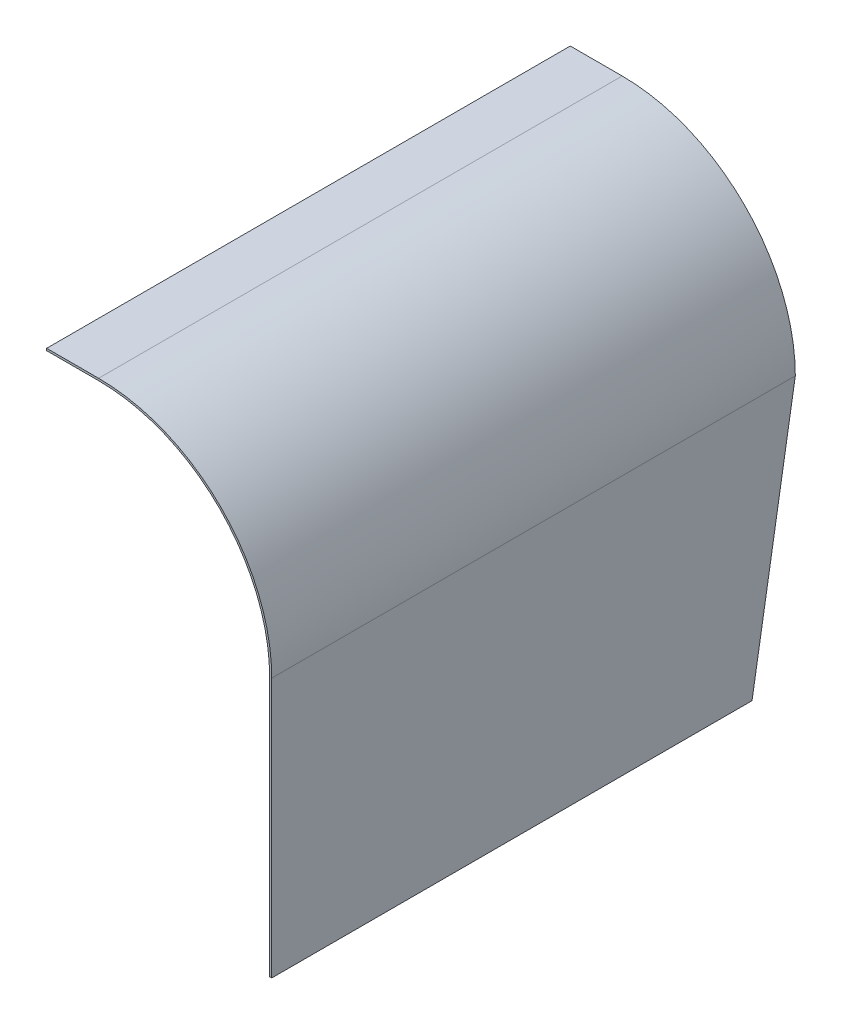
ISO-10303-21;
HEADER;
FILE_DESCRIPTION(('STEP AP214'),'2;1');
FILE_NAME('part.step','',(''),(''),'','','');
FILE_SCHEMA(('AUTOMOTIVE_DESIGN { 1 0 10303 214 1 1 1 1 }'));
ENDSEC;
DATA;
#1=APPLICATION_CONTEXT('core data for automotive mechanical design processes');
#2=APPLICATION_PROTOCOL_DEFINITION('international standard','automotive_design',2000,#1);
#3=PRODUCT_CONTEXT('',#1,'mechanical');
#4=PRODUCT('Part','Part','',(#3));
#5=PRODUCT_RELATED_PRODUCT_CATEGORY('part','',(#4));
#6=PRODUCT_DEFINITION_FORMATION('','',#4);
#7=PRODUCT_DEFINITION_CONTEXT('part definition',#1,'design');
#8=PRODUCT_DEFINITION('design','',#6,#7);
#9=PRODUCT_DEFINITION_SHAPE('','',#8);
#10=(LENGTH_UNIT() NAMED_UNIT(*) SI_UNIT(.MILLI.,.METRE.));
#11=(NAMED_UNIT(*) PLANE_ANGLE_UNIT() SI_UNIT($,.RADIAN.));
#12=(NAMED_UNIT(*) SI_UNIT($,.STERADIAN.) SOLID_ANGLE_UNIT());
#13=UNCERTAINTY_MEASURE_WITH_UNIT(LENGTH_MEASURE(1.E-05),#10,'distance_accuracy_value','');
#14=(GEOMETRIC_REPRESENTATION_CONTEXT(3) GLOBAL_UNCERTAINTY_ASSIGNED_CONTEXT((#13)) GLOBAL_UNIT_ASSIGNED_CONTEXT((#10,
#11,#12)) REPRESENTATION_CONTEXT('',''));
#15=CARTESIAN_POINT('',(0.,0.,0.));
#16=DIRECTION('',(0.,0.,1.));
#17=DIRECTION('',(1.,0.,0.));
#18=AXIS2_PLACEMENT_3D('',#15,#16,#17);
#19=CARTESIAN_POINT('',(128.785999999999,-100.,302.428));
#20=DIRECTION('',(1.,0.,0.));
#21=DIRECTION('',(0.,1.,0.));
#22=AXIS2_PLACEMENT_3D('',#19,#20,#21);
#23=PLANE('',#22);
#24=DIRECTION('',(0.,0.,-1.));
#25=VECTOR('',#24,1.);
#26=CARTESIAN_POINT('',(128.785999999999,-100.,302.428));
#27=LINE('',#26,#25);
#28=CARTESIAN_POINT('',(128.785999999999,-100.,302.428));
#29=VERTEX_POINT('',#28);
#30=CARTESIAN_POINT('',(128.785999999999,-100.,0.));
#31=VERTEX_POINT('',#30);
#32=EDGE_CURVE('E135',#29,#31,#27,.T.);
#33=ORIENTED_EDGE('',*,*,#32,.T.);
#34=DIRECTION('',(0.,-0.986393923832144,0.164398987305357));
#35=VECTOR('',#34,1.);
#36=CARTESIAN_POINT('',(128.785999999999,-149.042378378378,8.17372972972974));
#37=LINE('',#36,#35);
#38=CARTESIAN_POINT('',(128.785999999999,-250.,25.));
#39=VERTEX_POINT('',#38);
#40=EDGE_CURVE('E86',#31,#39,#37,.T.);
#41=ORIENTED_EDGE('',*,*,#40,.T.);
#42=DIRECTION('',(0.,0.,-1.));
#43=VECTOR('',#42,1.);
#44=CARTESIAN_POINT('',(128.785999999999,-250.,302.428));
#45=LINE('',#44,#43);
#46=CARTESIAN_POINT('',(128.785999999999,-250.,302.428));
#47=VERTEX_POINT('',#46);
#48=EDGE_CURVE('E51',#47,#39,#45,.T.);
#49=ORIENTED_EDGE('',*,*,#48,.F.);
#50=DIRECTION('',(0.,-1.,0.));
#51=VECTOR('',#50,1.);
#52=CARTESIAN_POINT('',(128.785999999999,-100.,302.428));
#53=LINE('',#52,#51);
#54=EDGE_CURVE('E92',#29,#47,#53,.T.);
#55=ORIENTED_EDGE('',*,*,#54,.F.);
#56=EDGE_LOOP('',(#33,#41,#49,#55));
#57=FACE_BOUND('',#56,.T.);
#58=ADVANCED_FACE('F43',(#57),#23,.F.);
#59=CARTESIAN_POINT('',(129.999999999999,-250.,302.428));
#60=DIRECTION('',(0.,-1.,0.));
#61=DIRECTION('',(0.,0.,-1.));
#62=AXIS2_PLACEMENT_3D('',#59,#60,#61);
#63=PLANE('',#62);
#64=DIRECTION('',(1.,0.,0.));
#65=VECTOR('',#64,1.);
#66=CARTESIAN_POINT('',(119.999999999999,-250.,25.));
#67=LINE('',#66,#65);
#68=CARTESIAN_POINT('',(129.999999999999,-250.,25.));
#69=VERTEX_POINT('',#68);
#70=EDGE_CURVE('E164',#39,#69,#67,.T.);
#71=ORIENTED_EDGE('',*,*,#70,.T.);
#72=DIRECTION('',(0.,0.,-1.));
#73=VECTOR('',#72,1.);
#74=CARTESIAN_POINT('',(129.999999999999,-250.,302.428));
#75=LINE('',#74,#73);
#76=CARTESIAN_POINT('',(129.999999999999,-250.,302.428));
#77=VERTEX_POINT('',#76);
#78=EDGE_CURVE('E156',#77,#69,#75,.T.);
#79=ORIENTED_EDGE('',*,*,#78,.F.);
#80=DIRECTION('',(-1.,0.,0.));
#81=VECTOR('',#80,1.);
#82=CARTESIAN_POINT('',(129.999999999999,-250.,302.428));
#83=LINE('',#82,#81);
#84=EDGE_CURVE('E165',#77,#47,#83,.T.);
#85=ORIENTED_EDGE('',*,*,#84,.T.);
#86=ORIENTED_EDGE('',*,*,#48,.T.);
#87=EDGE_LOOP('',(#71,#79,#85,#86));
#88=FACE_BOUND('',#87,.T.);
#89=ADVANCED_FACE('F162',(#88),#63,.T.);
#90=CARTESIAN_POINT('',(129.999999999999,-100.,302.428));
#91=DIRECTION('',(1.,0.,0.));
#92=DIRECTION('',(0.,1.,0.));
#93=AXIS2_PLACEMENT_3D('',#90,#91,#92);
#94=PLANE('',#93);
#95=DIRECTION('',(0.,-0.986393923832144,0.164398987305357));
#96=VECTOR('',#95,1.);
#97=CARTESIAN_POINT('',(129.999999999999,-100.,0.));
#98=LINE('',#97,#96);
#99=CARTESIAN_POINT('',(129.999999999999,-100.,0.));
#100=VERTEX_POINT('',#99);
#101=EDGE_CURVE('E168',#100,#69,#98,.T.);
#102=ORIENTED_EDGE('',*,*,#101,.F.);
#103=DIRECTION('',(0.,0.,-1.));
#104=VECTOR('',#103,1.);
#105=CARTESIAN_POINT('',(129.999999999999,-100.,302.428));
#106=LINE('',#105,#104);
#107=CARTESIAN_POINT('',(129.999999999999,-100.,302.428));
#108=VERTEX_POINT('',#107);
#109=EDGE_CURVE('E153',#108,#100,#106,.T.);
#110=ORIENTED_EDGE('',*,*,#109,.F.);
#111=DIRECTION('',(0.,-1.,0.));
#112=VECTOR('',#111,1.);
#113=CARTESIAN_POINT('',(129.999999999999,-100.,302.428));
#114=LINE('',#113,#112);
#115=EDGE_CURVE('E174',#108,#77,#114,.T.);
#116=ORIENTED_EDGE('',*,*,#115,.T.);
#117=ORIENTED_EDGE('',*,*,#78,.T.);
#118=EDGE_LOOP('',(#102,#110,#116,#117));
#119=FACE_BOUND('',#118,.T.);
#120=ADVANCED_FACE('F203',(#119),#94,.T.);
#121=CARTESIAN_POINT('',(29.9999999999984,-100.,302.428));
#122=DIRECTION('',(0.,0.,-1.));
#123=DIRECTION('',(-1.,0.,0.));
#124=AXIS2_PLACEMENT_3D('',#121,#122,#123);
#125=CYLINDRICAL_SURFACE('',#124,100.);
#126=CARTESIAN_POINT('',(30.,-100.,0.));
#127=DIRECTION('',(0.,0.,-1.));
#128=DIRECTION('',(-1.,0.,0.));
#129=AXIS2_PLACEMENT_3D('',#126,#127,#128);
#130=CIRCLE('',#129,100.);
#131=CARTESIAN_POINT('',(29.9999999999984,0.,0.));
#132=VERTEX_POINT('',#131);
#133=EDGE_CURVE('E136',#132,#100,#130,.T.);
#134=ORIENTED_EDGE('',*,*,#133,.F.);
#135=DIRECTION('',(0.,0.,-1.));
#136=VECTOR('',#135,1.);
#137=CARTESIAN_POINT('',(30.,0.,302.428));
#138=LINE('',#137,#136);
#139=CARTESIAN_POINT('',(30.,0.,302.428));
#140=VERTEX_POINT('',#139);
#141=EDGE_CURVE('E151',#140,#132,#138,.T.);
#142=ORIENTED_EDGE('',*,*,#141,.F.);
#143=CARTESIAN_POINT('',(29.9999999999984,-100.,302.428));
#144=DIRECTION('',(0.,0.,-1.));
#145=DIRECTION('',(-1.,0.,0.));
#146=AXIS2_PLACEMENT_3D('',#143,#144,#145);
#147=CIRCLE('',#146,100.);
#148=EDGE_CURVE('E130',#140,#108,#147,.T.);
#149=ORIENTED_EDGE('',*,*,#148,.T.);
#150=ORIENTED_EDGE('',*,*,#109,.T.);
#151=EDGE_LOOP('',(#134,#142,#149,#150));
#152=FACE_BOUND('',#151,.T.);
#153=ADVANCED_FACE('F179',(#152),#125,.T.);
#154=CARTESIAN_POINT('',(0.,0.,302.428));
#155=DIRECTION('',(0.,1.,0.));
#156=DIRECTION('',(-1.,0.,0.));
#157=AXIS2_PLACEMENT_3D('',#154,#155,#156);
#158=PLANE('',#157);
#159=DIRECTION('',(1.,0.,0.));
#160=VECTOR('',#159,1.);
#161=CARTESIAN_POINT('',(-1.60982338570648E-12,0.,0.));
#162=LINE('',#161,#160);
#163=CARTESIAN_POINT('',(-1.60982338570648E-12,0.,0.));
#164=VERTEX_POINT('',#163);
#165=EDGE_CURVE('E139',#164,#132,#162,.T.);
#166=ORIENTED_EDGE('',*,*,#165,.F.);
#167=DIRECTION('',(0.,0.,-1.));
#168=VECTOR('',#167,1.);
#169=CARTESIAN_POINT('',(0.,0.,302.428));
#170=LINE('',#169,#168);
#171=CARTESIAN_POINT('',(0.,0.,302.428));
#172=VERTEX_POINT('',#171);
#173=EDGE_CURVE('E118',#172,#164,#170,.T.);
#174=ORIENTED_EDGE('',*,*,#173,.F.);
#175=DIRECTION('',(1.,0.,0.));
#176=VECTOR('',#175,1.);
#177=CARTESIAN_POINT('',(0.,0.,302.428));
#178=LINE('',#177,#176);
#179=EDGE_CURVE('E128',#172,#140,#178,.T.);
#180=ORIENTED_EDGE('',*,*,#179,.T.);
#181=ORIENTED_EDGE('',*,*,#141,.T.);
#182=EDGE_LOOP('',(#166,#174,#180,#181));
#183=FACE_BOUND('',#182,.T.);
#184=ADVANCED_FACE('F184',(#183),#158,.T.);
#185=CARTESIAN_POINT('',(0.,-1.21399999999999,302.428));
#186=DIRECTION('',(-1.,0.,0.));
#187=DIRECTION('',(0.,-1.,0.));
#188=AXIS2_PLACEMENT_3D('',#185,#186,#187);
#189=PLANE('',#188);
#190=DIRECTION('',(0.,1.,0.));
#191=VECTOR('',#190,1.);
#192=CARTESIAN_POINT('',(-1.60982338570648E-12,-1.21399999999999,0.));
#193=LINE('',#192,#191);
#194=CARTESIAN_POINT('',(-1.60982338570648E-12,-1.21399999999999,0.));
#195=VERTEX_POINT('',#194);
#196=EDGE_CURVE('E117',#195,#164,#193,.T.);
#197=ORIENTED_EDGE('',*,*,#196,.F.);
#198=DIRECTION('',(0.,0.,-1.));
#199=VECTOR('',#198,1.);
#200=CARTESIAN_POINT('',(0.,-1.21399999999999,302.428));
#201=LINE('',#200,#199);
#202=CARTESIAN_POINT('',(0.,-1.21399999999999,302.428));
#203=VERTEX_POINT('',#202);
#204=EDGE_CURVE('E111',#203,#195,#201,.T.);
#205=ORIENTED_EDGE('',*,*,#204,.F.);
#206=DIRECTION('',(0.,1.,0.));
#207=VECTOR('',#206,1.);
#208=CARTESIAN_POINT('',(0.,-1.21399999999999,302.428));
#209=LINE('',#208,#207);
#210=EDGE_CURVE('E115',#203,#172,#209,.T.);
#211=ORIENTED_EDGE('',*,*,#210,.T.);
#212=ORIENTED_EDGE('',*,*,#173,.T.);
#213=EDGE_LOOP('',(#197,#205,#211,#212));
#214=FACE_BOUND('',#213,.T.);
#215=ADVANCED_FACE('F113',(#214),#189,.T.);
#216=CARTESIAN_POINT('',(0.,-1.21399999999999,302.428));
#217=DIRECTION('',(0.,1.,0.));
#218=DIRECTION('',(-1.,0.,0.));
#219=AXIS2_PLACEMENT_3D('',#216,#217,#218);
#220=PLANE('',#219);
#221=DIRECTION('',(1.,0.,0.));
#222=VECTOR('',#221,1.);
#223=CARTESIAN_POINT('',(-1.60982338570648E-12,-1.21399999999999,0.));
#224=LINE('',#223,#222);
#225=CARTESIAN_POINT('',(29.9999999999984,-1.21400000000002,0.));
#226=VERTEX_POINT('',#225);
#227=EDGE_CURVE('E79',#195,#226,#224,.T.);
#228=ORIENTED_EDGE('',*,*,#227,.T.);
#229=DIRECTION('',(0.,0.,-1.));
#230=VECTOR('',#229,1.);
#231=CARTESIAN_POINT('',(30.,-1.21399999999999,302.428));
#232=LINE('',#231,#230);
#233=CARTESIAN_POINT('',(30.,-1.21399999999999,302.428));
#234=VERTEX_POINT('',#233);
#235=EDGE_CURVE('E119',#234,#226,#232,.T.);
#236=ORIENTED_EDGE('',*,*,#235,.F.);
#237=DIRECTION('',(1.,0.,0.));
#238=VECTOR('',#237,1.);
#239=CARTESIAN_POINT('',(0.,-1.21399999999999,302.428));
#240=LINE('',#239,#238);
#241=EDGE_CURVE('E121',#203,#234,#240,.T.);
#242=ORIENTED_EDGE('',*,*,#241,.F.);
#243=ORIENTED_EDGE('',*,*,#204,.T.);
#244=EDGE_LOOP('',(#228,#236,#242,#243));
#245=FACE_BOUND('',#244,.T.);
#246=ADVANCED_FACE('F122',(#245),#220,.F.);
#247=CARTESIAN_POINT('',(29.9999999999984,-100.,302.428));
#248=DIRECTION('',(0.,0.,-1.));
#249=DIRECTION('',(-1.,0.,0.));
#250=AXIS2_PLACEMENT_3D('',#247,#248,#249);
#251=CYLINDRICAL_SURFACE('',#250,98.786);
#252=CARTESIAN_POINT('',(30.,-100.,0.));
#253=DIRECTION('',(0.,0.,1.));
#254=DIRECTION('',(1.,0.,0.));
#255=AXIS2_PLACEMENT_3D('',#252,#253,#254);
#256=CIRCLE('',#255,98.786);
#257=EDGE_CURVE('E144',#226,#31,#256,.F.);
#258=ORIENTED_EDGE('',*,*,#257,.T.);
#259=ORIENTED_EDGE('',*,*,#32,.F.);
#260=CARTESIAN_POINT('',(29.9999999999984,-100.,302.428));
#261=DIRECTION('',(0.,0.,1.));
#262=DIRECTION('',(1.,0.,0.));
#263=AXIS2_PLACEMENT_3D('',#260,#261,#262);
#264=CIRCLE('',#263,98.786);
#265=EDGE_CURVE('E59',#234,#29,#264,.F.);
#266=ORIENTED_EDGE('',*,*,#265,.F.);
#267=ORIENTED_EDGE('',*,*,#235,.T.);
#268=EDGE_LOOP('',(#258,#259,#266,#267));
#269=FACE_BOUND('',#268,.T.);
#270=ADVANCED_FACE('F189',(#269),#251,.F.);
#271=CARTESIAN_POINT('',(29.9999999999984,-100.,302.428));
#272=DIRECTION('',(0.,0.,-1.));
#273=DIRECTION('',(-1.,0.,0.));
#274=AXIS2_PLACEMENT_3D('',#271,#272,#273);
#275=PLANE('',#274);
#276=ORIENTED_EDGE('',*,*,#54,.T.);
#277=ORIENTED_EDGE('',*,*,#84,.F.);
#278=ORIENTED_EDGE('',*,*,#115,.F.);
#279=ORIENTED_EDGE('',*,*,#148,.F.);
#280=ORIENTED_EDGE('',*,*,#179,.F.);
#281=ORIENTED_EDGE('',*,*,#210,.F.);
#282=ORIENTED_EDGE('',*,*,#241,.T.);
#283=ORIENTED_EDGE('',*,*,#265,.T.);
#284=EDGE_LOOP('',(#276,#277,#278,#279,#280,#281,#282,#283));
#285=FACE_BOUND('',#284,.T.);
#286=ADVANCED_FACE('F125',(#285),#275,.F.);
#287=CARTESIAN_POINT('',(30.,-100.,0.));
#288=DIRECTION('',(0.,0.,-1.));
#289=DIRECTION('',(-1.,0.,0.));
#290=AXIS2_PLACEMENT_3D('',#287,#288,#289);
#291=PLANE('',#290);
#292=DIRECTION('',(1.,0.,0.));
#293=VECTOR('',#292,1.);
#294=CARTESIAN_POINT('',(30.,-100.,0.));
#295=LINE('',#294,#293);
#296=EDGE_CURVE('E13',#31,#100,#295,.T.);
#297=ORIENTED_EDGE('',*,*,#296,.F.);
#298=ORIENTED_EDGE('',*,*,#257,.F.);
#299=ORIENTED_EDGE('',*,*,#227,.F.);
#300=ORIENTED_EDGE('',*,*,#196,.T.);
#301=ORIENTED_EDGE('',*,*,#165,.T.);
#302=ORIENTED_EDGE('',*,*,#133,.T.);
#303=EDGE_LOOP('',(#297,#298,#299,#300,#301,#302));
#304=FACE_BOUND('',#303,.T.);
#305=ADVANCED_FACE('F186',(#304),#291,.T.);
#306=CARTESIAN_POINT('',(119.999999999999,-99.9999999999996,0.));
#307=DIRECTION('',(0.,0.164398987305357,0.986393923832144));
#308=DIRECTION('',(0.,-0.986393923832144,0.164398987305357));
#309=AXIS2_PLACEMENT_3D('',#306,#307,#308);
#310=PLANE('',#309);
#311=ORIENTED_EDGE('',*,*,#296,.T.);
#312=ORIENTED_EDGE('',*,*,#101,.T.);
#313=ORIENTED_EDGE('',*,*,#70,.F.);
#314=ORIENTED_EDGE('',*,*,#40,.F.);
#315=EDGE_LOOP('',(#311,#312,#313,#314));
#316=FACE_BOUND('',#315,.T.);
#317=ADVANCED_FACE('F236',(#316),#310,.F.);
#318=CLOSED_SHELL('',(#58,#89,#120,#153,#184,#215,#246,#270,#286,#305,#317));
#319=MANIFOLD_SOLID_BREP('B2',#318);
#320=ADVANCED_BREP_SHAPE_REPRESENTATION('',(#18,#319),#14);
#321=SHAPE_DEFINITION_REPRESENTATION(#9,#320);
ENDSEC;
END-ISO-10303-21;
